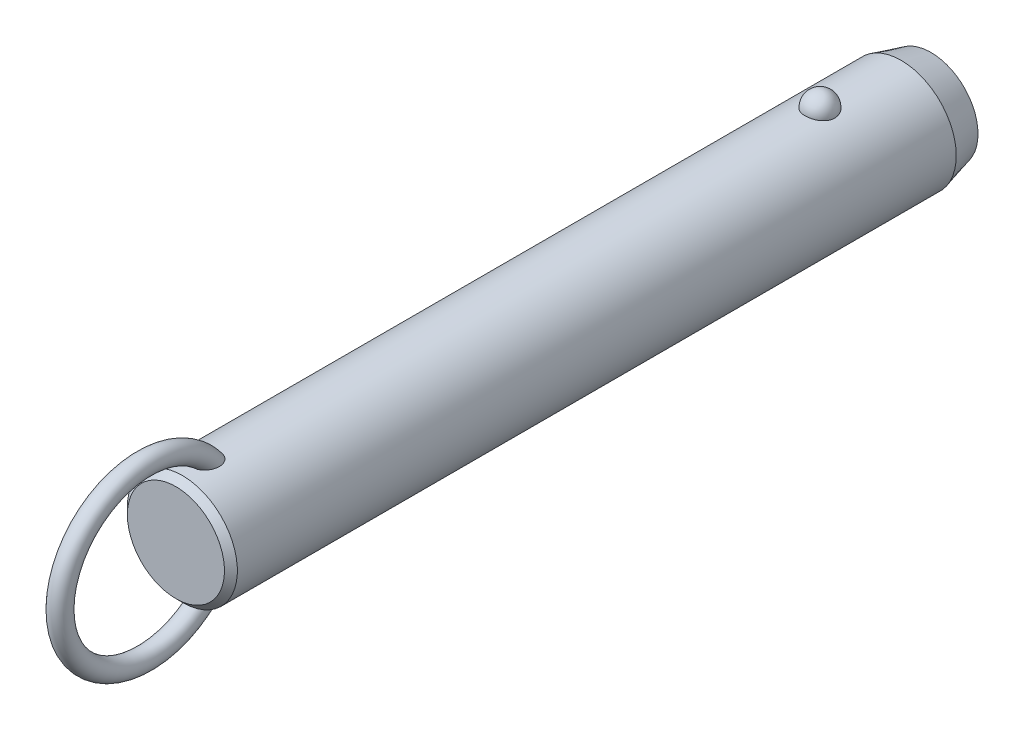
ISO-10303-21;
HEADER;
FILE_DESCRIPTION(('STEP AP214'),'2;1');
FILE_NAME('part.step','',(''),(''),'','','');
FILE_SCHEMA(('AUTOMOTIVE_DESIGN { 1 0 10303 214 1 1 1 1 }'));
ENDSEC;
DATA;
#1=APPLICATION_CONTEXT('core data for automotive mechanical design processes');
#2=APPLICATION_PROTOCOL_DEFINITION('international standard','automotive_design',2000,#1);
#3=PRODUCT_CONTEXT('',#1,'mechanical');
#4=PRODUCT('Part','Part','',(#3));
#5=PRODUCT_RELATED_PRODUCT_CATEGORY('part','',(#4));
#6=PRODUCT_DEFINITION_FORMATION('','',#4);
#7=PRODUCT_DEFINITION_CONTEXT('part definition',#1,'design');
#8=PRODUCT_DEFINITION('design','',#6,#7);
#9=PRODUCT_DEFINITION_SHAPE('','',#8);
#10=(LENGTH_UNIT() NAMED_UNIT(*) SI_UNIT(.MILLI.,.METRE.));
#11=(NAMED_UNIT(*) PLANE_ANGLE_UNIT() SI_UNIT($,.RADIAN.));
#12=(NAMED_UNIT(*) SI_UNIT($,.STERADIAN.) SOLID_ANGLE_UNIT());
#13=UNCERTAINTY_MEASURE_WITH_UNIT(LENGTH_MEASURE(1.E-05),#10,'distance_accuracy_value','');
#14=(GEOMETRIC_REPRESENTATION_CONTEXT(3) GLOBAL_UNCERTAINTY_ASSIGNED_CONTEXT((#13)) GLOBAL_UNIT_ASSIGNED_CONTEXT((#10,
#11,#12)) REPRESENTATION_CONTEXT('',''));
#15=CARTESIAN_POINT('',(0.,0.,0.));
#16=DIRECTION('',(0.,0.,1.));
#17=DIRECTION('',(1.,0.,0.));
#18=AXIS2_PLACEMENT_3D('',#15,#16,#17);
#19=CARTESIAN_POINT('',(0.,0.,114.3));
#20=DIRECTION('',(0.,0.,-1.));
#21=DIRECTION('',(-1.,0.,0.));
#22=AXIS2_PLACEMENT_3D('',#19,#20,#21);
#23=CYLINDRICAL_SURFACE('',#22,11.1);
#24=CARTESIAN_POINT('',(2.9724815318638,10.6945945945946,-3.));
#25=CARTESIAN_POINT('',(2.97247830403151,10.6945972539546,-2.83225059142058));
#26=CARTESIAN_POINT('',(2.95876598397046,10.6984356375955,-2.66445972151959));
#27=CARTESIAN_POINT('',(2.90424529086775,10.7133624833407,-2.33362381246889));
#28=CARTESIAN_POINT('',(2.8634252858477,10.7244540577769,-2.1705808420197));
#29=CARTESIAN_POINT('',(2.75573657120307,10.7526272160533,-1.85396767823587));
#30=CARTESIAN_POINT('',(2.68887937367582,10.7697061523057,-1.70039333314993));
#31=CARTESIAN_POINT('',(2.53079696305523,10.8079438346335,-1.40691598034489));
#32=CARTESIAN_POINT('',(2.43957264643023,10.8291024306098,-1.2670124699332));
#33=CARTESIAN_POINT('',(2.23458150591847,10.8732541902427,-1.00409565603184));
#34=CARTESIAN_POINT('',(2.12071295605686,10.8962553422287,-0.881162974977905));
#35=CARTESIAN_POINT('',(1.87365402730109,10.9414421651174,-0.656352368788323));
#36=CARTESIAN_POINT('',(1.74046358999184,10.9636278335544,-0.554474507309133));
#37=CARTESIAN_POINT('',(1.45872188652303,11.0046495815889,-0.374872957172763));
#38=CARTESIAN_POINT('',(1.31021276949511,11.0234944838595,-0.297085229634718));
#39=CARTESIAN_POINT('',(1.00170030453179,11.0557957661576,-0.167529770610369));
#40=CARTESIAN_POINT('',(0.841698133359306,11.0692526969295,-0.115759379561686));
#41=CARTESIAN_POINT('',(0.517607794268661,11.0890932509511,-0.0403925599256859));
#42=CARTESIAN_POINT('',(0.353633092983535,11.0955916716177,-0.0163383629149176));
#43=CARTESIAN_POINT('',(0.0238420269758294,11.1011989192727,0.0044517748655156));
#44=CARTESIAN_POINT('',(-0.141974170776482,11.1003084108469,0.00119017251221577));
#45=CARTESIAN_POINT('',(-0.468405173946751,11.0912990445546,-0.0323233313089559));
#46=CARTESIAN_POINT('',(-0.629059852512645,11.0832767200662,-0.0622147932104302));
#47=CARTESIAN_POINT('',(-0.942937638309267,11.0609962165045,-0.147645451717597));
#48=CARTESIAN_POINT('',(-1.09616062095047,11.0467379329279,-0.203185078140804));
#49=CARTESIAN_POINT('',(-1.39181061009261,11.0134071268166,-0.3387529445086));
#50=CARTESIAN_POINT('',(-1.53417383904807,10.9943086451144,-0.418913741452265));
#51=CARTESIAN_POINT('',(-1.80342160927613,10.9533667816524,-0.60144882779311));
#52=CARTESIAN_POINT('',(-1.9303046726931,10.9315231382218,-0.703825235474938));
#53=CARTESIAN_POINT('',(-2.16747598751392,10.887005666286,-0.930091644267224));
#54=CARTESIAN_POINT('',(-2.27742774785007,10.8643239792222,-1.05433291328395));
#55=CARTESIAN_POINT('',(-2.47517316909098,10.8209886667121,-1.31966633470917));
#56=CARTESIAN_POINT('',(-2.56296538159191,10.8003351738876,-1.46075958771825));
#57=CARTESIAN_POINT('',(-2.71500300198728,10.7631304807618,-1.75753646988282));
#58=CARTESIAN_POINT('',(-2.77898901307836,10.7466250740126,-1.91335887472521));
#59=CARTESIAN_POINT('',(-2.88046189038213,10.7198747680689,-2.2339152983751));
#60=CARTESIAN_POINT('',(-2.91794947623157,10.709629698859,-2.39864907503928));
#61=CARTESIAN_POINT('',(-2.96537819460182,10.6965949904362,-2.73165170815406));
#62=CARTESIAN_POINT('',(-2.97542891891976,10.693775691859,-2.89990378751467));
#63=CARTESIAN_POINT('',(-2.96804271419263,10.6958279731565,-3.235752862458));
#64=CARTESIAN_POINT('',(-2.95060646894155,10.7006993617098,-3.40334987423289));
#65=CARTESIAN_POINT('',(-2.88883358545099,10.71753912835,-3.73233906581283));
#66=CARTESIAN_POINT('',(-2.84462026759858,10.7294749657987,-3.89375610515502));
#67=CARTESIAN_POINT('',(-2.73050447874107,10.7590797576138,-4.20667949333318));
#68=CARTESIAN_POINT('',(-2.66060103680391,10.7767489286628,-4.35818546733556));
#69=CARTESIAN_POINT('',(-2.49642559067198,10.8159599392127,-4.6478542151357));
#70=CARTESIAN_POINT('',(-2.40203047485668,10.8375211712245,-4.78594458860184));
#71=CARTESIAN_POINT('',(-2.19143488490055,10.8820570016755,-5.0441038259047));
#72=CARTESIAN_POINT('',(-2.07523364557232,10.9050316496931,-5.16417205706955));
#73=CARTESIAN_POINT('',(-1.82361254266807,10.9499219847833,-5.38334833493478));
#74=CARTESIAN_POINT('',(-1.68812945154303,10.9718338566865,-5.48238464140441));
#75=CARTESIAN_POINT('',(-1.40191298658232,11.0120611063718,-5.65618873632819));
#76=CARTESIAN_POINT('',(-1.25118062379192,11.0303767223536,-5.73095813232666));
#77=CARTESIAN_POINT('',(-0.940570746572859,11.0611653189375,-5.85334725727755));
#78=CARTESIAN_POINT('',(-0.780821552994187,11.0737044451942,-5.90127578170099));
#79=CARTESIAN_POINT('',(-0.455204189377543,11.0918598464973,-5.96992976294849));
#80=CARTESIAN_POINT('',(-0.289336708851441,11.0974768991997,-5.99065827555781));
#81=CARTESIAN_POINT('',(0.0406846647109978,11.1011307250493,-6.00418773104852));
#82=CARTESIAN_POINT('',(0.204817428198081,11.099299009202,-5.99747318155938));
#83=CARTESIAN_POINT('',(0.5295530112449,11.088551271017,-5.9574031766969));
#84=CARTESIAN_POINT('',(0.69015594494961,11.0796354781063,-5.92404858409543));
#85=CARTESIAN_POINT('',(1.0027760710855,11.0557204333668,-5.83180084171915));
#86=CARTESIAN_POINT('',(1.15482001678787,11.0407414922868,-5.77299291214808));
#87=CARTESIAN_POINT('',(1.44678373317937,11.0062913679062,-5.63147366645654));
#88=CARTESIAN_POINT('',(1.58670279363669,10.9868199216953,-5.54876095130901));
#89=CARTESIAN_POINT('',(1.8527023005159,10.9451315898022,-5.36027644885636));
#90=CARTESIAN_POINT('',(1.97855158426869,10.9228788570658,-5.25418644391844));
#91=CARTESIAN_POINT('',(2.21080872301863,10.8782509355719,-5.02251354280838));
#92=CARTESIAN_POINT('',(2.31721312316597,10.8558757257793,-4.89692718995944));
#93=CARTESIAN_POINT('',(2.5094551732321,10.8130715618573,-4.62745408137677));
#94=CARTESIAN_POINT('',(2.59493284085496,10.7926798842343,-4.48330448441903));
#95=CARTESIAN_POINT('',(2.740862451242,10.7565495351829,-4.18236358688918));
#96=CARTESIAN_POINT('',(2.80132490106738,10.7408089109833,-4.02557762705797));
#97=CARTESIAN_POINT('',(2.88959070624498,10.7173718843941,-3.72475308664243));
#98=CARTESIAN_POINT('',(2.92062102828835,10.7088950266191,-3.58171216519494));
#99=CARTESIAN_POINT('',(2.96206765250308,10.6975052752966,-3.29245795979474));
#100=CARTESIAN_POINT('',(2.97248434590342,10.6945922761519,-3.14624473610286));
#101=CARTESIAN_POINT('',(2.9724815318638,10.6945945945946,-3.));
#102=B_SPLINE_CURVE_WITH_KNOTS('',3,(#24,#25,#26,#27,#28,#29,#30,#31,#32,#33,#34,#35,#36,#37,
#38,#39,#40,#41,#42,#43,#44,#45,#46,#47,#48,#49,#50,#51,#52,#53,#54,#55,#56,#57,#58,#59,#60,#61,
#62,#63,#64,#65,#66,#67,#68,#69,#70,#71,#72,#73,#74,#75,#76,#77,#78,#79,#80,#81,#82,#83,#84,#85,
#86,#87,#88,#89,#90,#91,#92,#93,#94,#95,#96,#97,#98,#99,#100,#101),.UNSPECIFIED.,.T.,.F.,(4,2,2,
2,2,2,2,2,2,2,2,2,2,2,2,2,2,2,2,2,2,2,2,2,2,2,2,2,2,2,2,2,2,2,2,2,2,2,4),(0.,0.502722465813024,
1.00566079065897,1.5083769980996,2.01107471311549,2.51608392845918,3.02109467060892,
3.52475118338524,4.02835620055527,4.523518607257,5.0186364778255,5.50715297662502,
5.9956776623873,6.48688002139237,6.97812923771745,7.47814366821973,7.9781907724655,
8.48353712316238,8.9888697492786,9.49218093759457,9.99547960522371,10.4964777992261,
10.997494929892,11.5010810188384,12.0046847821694,12.5099796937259,13.0152411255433,
13.5145635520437,14.0138298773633,14.5043200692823,14.9947943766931,15.4836390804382,
15.9725123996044,16.4685040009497,16.9645836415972,17.4686765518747,17.972557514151,
18.410841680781,18.849117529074),.UNSPECIFIED.);
#103=CARTESIAN_POINT('',(2.9724815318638,10.6945945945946,-3.));
#104=VERTEX_POINT('',#103);
#105=EDGE_CURVE('E41',#104,#104,#102,.T.);
#106=ORIENTED_EDGE('',*,*,#105,.T.);
#107=EDGE_LOOP('',(#106));
#108=FACE_BOUND('',#107,.T.);
#109=CARTESIAN_POINT('',(0.,0.,125.7));
#110=DIRECTION('',(0.,0.,1.));
#111=DIRECTION('',(1.,0.,0.));
#112=AXIS2_PLACEMENT_3D('',#109,#110,#111);
#113=CIRCLE('',#112,11.1);
#114=CARTESIAN_POINT('',(-11.1,0.,125.7));
#115=VERTEX_POINT('',#114);
#116=EDGE_CURVE('E10',#115,#115,#113,.F.);
#117=ORIENTED_EDGE('',*,*,#116,.T.);
#118=EDGE_LOOP('',(#117));
#119=FACE_BOUND('',#118,.T.);
#120=CARTESIAN_POINT('',(-0.564520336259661,-11.0856356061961,117.957815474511));
#121=CARTESIAN_POINT('',(-0.667202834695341,-11.0804062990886,117.991283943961));
#122=CARTESIAN_POINT('',(-0.766875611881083,-11.0738877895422,118.033835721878));
#123=CARTESIAN_POINT('',(-0.957284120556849,-11.0590576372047,118.135419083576));
#124=CARTESIAN_POINT('',(-1.04801616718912,-11.0507452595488,118.19445742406));
#125=CARTESIAN_POINT('',(-1.21800952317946,-11.0333016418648,118.326529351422));
#126=CARTESIAN_POINT('',(-1.29730805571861,-11.0241732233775,118.399515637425));
#127=CARTESIAN_POINT('',(-1.44337665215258,-11.0060026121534,118.557037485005));
#128=CARTESIAN_POINT('',(-1.51014622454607,-10.9969604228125,118.641573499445));
#129=CARTESIAN_POINT('',(-1.63454620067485,-10.9791841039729,118.825521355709));
#130=CARTESIAN_POINT('',(-1.69127003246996,-10.9705107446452,118.925549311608));
#131=CARTESIAN_POINT('',(-1.78980785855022,-10.9548648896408,119.132790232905));
#132=CARTESIAN_POINT('',(-1.83161214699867,-10.9478935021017,119.240007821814));
#133=CARTESIAN_POINT('',(-1.91557028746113,-10.9335803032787,119.505408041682));
#134=CARTESIAN_POINT('',(-1.95040620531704,-10.9273269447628,119.665980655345));
#135=CARTESIAN_POINT('',(-1.99388326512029,-10.9194709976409,119.990697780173));
#136=CARTESIAN_POINT('',(-2.00248051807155,-10.9178762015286,120.154847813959));
#137=CARTESIAN_POINT('',(-1.99551615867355,-10.9191578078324,120.524650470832));
#138=CARTESIAN_POINT('',(-1.9732206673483,-10.9232807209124,120.730191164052));
#139=CARTESIAN_POINT('',(-1.9152976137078,-10.9335244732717,121.033595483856));
#140=CARTESIAN_POINT('',(-1.8918457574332,-10.9376266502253,121.134088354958));
#141=CARTESIAN_POINT('',(-1.83700674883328,-10.9469720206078,121.332855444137));
#142=CARTESIAN_POINT('',(-1.80562070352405,-10.9522150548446,121.431129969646));
#143=CARTESIAN_POINT('',(-1.73463055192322,-10.9636837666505,121.625914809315));
#144=CARTESIAN_POINT('',(-1.6949341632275,-10.9699202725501,121.722390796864));
#145=CARTESIAN_POINT('',(-1.6074514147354,-10.9830806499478,121.911626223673));
#146=CARTESIAN_POINT('',(-1.55966150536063,-10.9900048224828,122.004384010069));
#147=CARTESIAN_POINT('',(-1.45591812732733,-11.0042280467,122.184690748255));
#148=CARTESIAN_POINT('',(-1.40000013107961,-11.0115253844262,122.272260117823));
#149=CARTESIAN_POINT('',(-1.2793747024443,-11.0261911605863,122.441029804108));
#150=CARTESIAN_POINT('',(-1.2146783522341,-11.0335594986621,122.52223795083));
#151=CARTESIAN_POINT('',(-1.08218150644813,-11.0473027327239,122.669001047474));
#152=CARTESIAN_POINT('',(-1.0152263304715,-11.0537063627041,122.735309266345));
#153=CARTESIAN_POINT('',(-0.872952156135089,-11.065850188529,122.858378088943));
#154=CARTESIAN_POINT('',(-0.797642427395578,-11.0715911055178,122.915149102));
#155=CARTESIAN_POINT('',(-0.651396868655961,-11.081071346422,123.007515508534));
#156=CARTESIAN_POINT('',(-0.581712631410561,-11.0849841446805,123.045049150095));
#157=CARTESIAN_POINT('',(-0.437066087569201,-11.0916271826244,123.108259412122));
#158=CARTESIAN_POINT('',(-0.362109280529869,-11.0943586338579,123.133948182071));
#159=CARTESIAN_POINT('',(-0.207828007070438,-11.0983242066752,123.171117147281));
#160=CARTESIAN_POINT('',(-0.128467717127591,-11.0995432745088,123.182454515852));
#161=CARTESIAN_POINT('',(0.0309101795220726,-11.1002423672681,123.188965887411));
#162=CARTESIAN_POINT('',(0.110927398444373,-11.0997233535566,123.184148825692));
#163=CARTESIAN_POINT('',(0.256406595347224,-11.097240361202,123.160959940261));
#164=CARTESIAN_POINT('',(0.322235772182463,-11.0955074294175,123.144754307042));
#165=CARTESIAN_POINT('',(0.450635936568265,-11.0910350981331,123.102600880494));
#166=CARTESIAN_POINT('',(0.513205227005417,-11.0882951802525,123.076648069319));
#167=CARTESIAN_POINT('',(0.6626263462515,-11.0805620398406,123.002607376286));
#168=CARTESIAN_POINT('',(0.74712753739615,-11.0751144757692,122.949845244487));
#169=CARTESIAN_POINT('',(0.906756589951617,-11.0631932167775,122.831720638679));
#170=CARTESIAN_POINT('',(0.981859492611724,-11.0567168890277,122.766325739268));
#171=CARTESIAN_POINT('',(1.10712207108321,-11.0447856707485,122.64226337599));
#172=CARTESIAN_POINT('',(1.15909566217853,-11.0394280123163,122.585383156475));
#173=CARTESIAN_POINT('',(1.25791923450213,-11.0286040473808,122.467327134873));
#174=CARTESIAN_POINT('',(1.30476642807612,-11.0231376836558,122.406149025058));
#175=CARTESIAN_POINT('',(1.43818612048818,-11.0068027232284,122.217305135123));
#176=CARTESIAN_POINT('',(1.51751767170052,-10.9960104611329,122.084453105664));
#177=CARTESIAN_POINT('',(1.63597546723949,-10.9788847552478,121.853137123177));
#178=CARTESIAN_POINT('',(1.67988876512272,-10.9722190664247,121.757053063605));
#179=CARTESIAN_POINT('',(1.75953241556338,-10.9597298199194,121.561431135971));
#180=CARTESIAN_POINT('',(1.79525967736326,-10.9539065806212,121.461891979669));
#181=CARTESIAN_POINT('',(1.85844731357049,-10.9433632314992,121.26021118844));
#182=CARTESIAN_POINT('',(1.88591073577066,-10.9386427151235,121.158070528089));
#183=CARTESIAN_POINT('',(1.93234324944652,-10.9305350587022,120.951819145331));
#184=CARTESIAN_POINT('',(1.95131065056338,-10.9271481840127,120.847708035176));
#185=CARTESIAN_POINT('',(1.99040203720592,-10.9201183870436,120.565458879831));
#186=CARTESIAN_POINT('',(2.00221217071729,-10.9179256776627,120.386037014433));
#187=CARTESIAN_POINT('',(1.99711676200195,-10.9188636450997,120.027713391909));
#188=CARTESIAN_POINT('',(1.98026150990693,-10.9219849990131,119.848811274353));
#189=CARTESIAN_POINT('',(1.92151657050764,-10.9324473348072,119.53645144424));
#190=CARTESIAN_POINT('',(1.88605081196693,-10.9386915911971,119.401759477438));
#191=CARTESIAN_POINT('',(1.79393020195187,-10.9541780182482,119.139966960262));
#192=CARTESIAN_POINT('',(1.73729868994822,-10.9634168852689,119.012858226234));
#193=CARTESIAN_POINT('',(1.61237037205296,-10.9824218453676,118.789418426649));
#194=CARTESIAN_POINT('',(1.54715374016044,-10.9918945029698,118.691345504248));
#195=CARTESIAN_POINT('',(1.40127026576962,-11.0114415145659,118.507434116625));
#196=CARTESIAN_POINT('',(1.3206074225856,-11.0215157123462,118.421592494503));
#197=CARTESIAN_POINT('',(1.1447478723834,-11.041168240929,118.265163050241));
#198=CARTESIAN_POINT('',(1.04947805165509,-11.0507437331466,118.194656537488));
#199=CARTESIAN_POINT('',(0.84727806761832,-11.0680789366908,118.072640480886));
#200=CARTESIAN_POINT('',(0.740351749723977,-11.0758392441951,118.021124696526));
#201=CARTESIAN_POINT('',(0.529289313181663,-11.0878275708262,117.943485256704));
#202=CARTESIAN_POINT('',(0.425895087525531,-11.0923259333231,117.915377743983));
#203=CARTESIAN_POINT('',(0.215723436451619,-11.0984001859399,117.877703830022));
#204=CARTESIAN_POINT('',(0.108947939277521,-11.0999777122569,117.868127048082));
#205=CARTESIAN_POINT('',(-0.0938962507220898,-11.1000196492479,117.867877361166));
#206=CARTESIAN_POINT('',(-0.189967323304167,-11.0987797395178,117.875408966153));
#207=CARTESIAN_POINT('',(-0.379657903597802,-11.0939111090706,117.905507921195));
#208=CARTESIAN_POINT('',(-0.473277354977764,-11.0902823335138,117.928075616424));
#209=CARTESIAN_POINT('',(-0.564520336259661,-11.0856356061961,117.957815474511));
#210=B_SPLINE_CURVE_WITH_KNOTS('',3,(#120,#121,#122,#123,#124,#125,#126,#127,#128,#129,#130,
#131,#132,#133,#134,#135,#136,#137,#138,#139,#140,#141,#142,#143,#144,#145,#146,#147,#148,#149,
#150,#151,#152,#153,#154,#155,#156,#157,#158,#159,#160,#161,#162,#163,#164,#165,#166,#167,#168,
#169,#170,#171,#172,#173,#174,#175,#176,#177,#178,#179,#180,#181,#182,#183,#184,#185,#186,#187,
#188,#189,#190,#191,#192,#193,#194,#195,#196,#197,#198,#199,#200,#201,#202,#203,#204,#205,#206,
#207,#208,#209),.UNSPECIFIED.,.T.,.F.,(4,2,2,2,2,2,2,2,2,2,2,2,2,2,2,2,2,2,2,2,2,2,2,2,2,2,2,2,
2,2,2,2,2,2,2,2,2,2,2,2,2,2,2,2,4),(0.,0.323999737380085,0.648132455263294,0.971184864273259,
1.2942499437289,1.6388623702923,1.98369857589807,2.47426059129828,2.96564271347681,
3.58257396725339,3.89215258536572,4.201688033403,4.51486273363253,4.82817514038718,
5.14015911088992,5.45175282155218,5.734428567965,6.01679375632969,6.25364580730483,
6.49025437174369,6.72919963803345,6.96801276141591,7.17061258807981,7.37331685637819,
7.67094989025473,7.9693572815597,8.20075067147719,8.43226927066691,8.89581623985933,
9.21306533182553,9.53043400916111,9.84768549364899,10.1650000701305,10.7022930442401,
11.2386443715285,11.6553390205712,12.0715755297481,12.4245637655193,12.7774607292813,
13.1321855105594,13.4867936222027,13.8068771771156,14.1267813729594,14.4146787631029,
14.7025827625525),.UNSPECIFIED.);
#211=CARTESIAN_POINT('',(-0.564520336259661,-11.0856356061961,117.957815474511));
#212=VERTEX_POINT('',#211);
#213=EDGE_CURVE('E60',#212,#212,#210,.T.);
#214=ORIENTED_EDGE('',*,*,#213,.T.);
#215=EDGE_LOOP('',(#214));
#216=FACE_BOUND('',#215,.T.);
#217=CARTESIAN_POINT('',(-0.564520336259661,11.0856356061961,117.957815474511));
#218=CARTESIAN_POINT('',(-0.468542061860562,11.0905203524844,117.926545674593));
#219=CARTESIAN_POINT('',(-0.36979381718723,11.0942886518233,117.903157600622));
#220=CARTESIAN_POINT('',(-0.169555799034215,11.0991586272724,117.873085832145));
#221=CARTESIAN_POINT('',(-0.0680604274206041,11.1002543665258,117.86643932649));
#222=CARTESIAN_POINT('',(0.134549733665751,11.099646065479,117.870157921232));
#223=CARTESIAN_POINT('',(0.235664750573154,11.0979441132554,117.88051033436));
#224=CARTESIAN_POINT('',(0.434632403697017,11.0919342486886,117.917831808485));
#225=CARTESIAN_POINT('',(0.532486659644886,11.0876276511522,117.944792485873));
#226=CARTESIAN_POINT('',(0.722445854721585,11.0768742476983,118.0144096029));
#227=CARTESIAN_POINT('',(0.814543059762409,11.0704246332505,118.057086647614));
#228=CARTESIAN_POINT('',(0.99056508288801,11.0560659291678,118.156648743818));
#229=CARTESIAN_POINT('',(1.07448844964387,11.048156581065,118.213536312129));
#230=CARTESIAN_POINT('',(1.23562672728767,11.0313221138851,118.342210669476));
#231=CARTESIAN_POINT('',(1.3124268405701,11.0223686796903,118.414511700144));
#232=CARTESIAN_POINT('',(1.45398030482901,11.0045918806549,118.570042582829));
#233=CARTESIAN_POINT('',(1.5187307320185,10.9957685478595,118.653275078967));
#234=CARTESIAN_POINT('',(1.64107232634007,10.9782087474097,118.836384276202));
#235=CARTESIAN_POINT('',(1.69743176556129,10.9695572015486,118.937089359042));
#236=CARTESIAN_POINT('',(1.79515063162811,10.9539887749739,119.145626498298));
#237=CARTESIAN_POINT('',(1.83649966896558,10.9470730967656,119.25346343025));
#238=CARTESIAN_POINT('',(1.91931148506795,10.9329211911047,119.520399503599));
#239=CARTESIAN_POINT('',(1.95340104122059,10.9267904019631,119.681861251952));
#240=CARTESIAN_POINT('',(1.99526195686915,10.9192174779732,120.00821631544));
#241=CARTESIAN_POINT('',(2.00298989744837,10.9177830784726,120.17311484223));
#242=CARTESIAN_POINT('',(1.9939625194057,10.9194420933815,120.544100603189));
#243=CARTESIAN_POINT('',(1.97050829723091,10.923774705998,120.75003871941));
#244=CARTESIAN_POINT('',(1.91079643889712,10.9343131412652,121.053901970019));
#245=CARTESIAN_POINT('',(1.88673702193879,10.9385106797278,121.154529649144));
#246=CARTESIAN_POINT('',(1.83065508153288,10.9480376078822,121.353510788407));
#247=CARTESIAN_POINT('',(1.79863369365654,10.9533668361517,121.451864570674));
#248=CARTESIAN_POINT('',(1.72633365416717,10.9649954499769,121.646720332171));
#249=CARTESIAN_POINT('',(1.68596409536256,10.9713053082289,121.74318790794));
#250=CARTESIAN_POINT('',(1.59707998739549,10.9845964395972,121.932323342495));
#251=CARTESIAN_POINT('',(1.54856169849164,10.9915780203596,122.024989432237));
#252=CARTESIAN_POINT('',(1.44330168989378,11.0058935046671,122.204975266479));
#253=CARTESIAN_POINT('',(1.38659749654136,11.0132257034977,122.292316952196));
#254=CARTESIAN_POINT('',(1.26431158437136,11.0279330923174,122.460456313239));
#255=CARTESIAN_POINT('',(1.19874160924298,11.0353082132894,122.541262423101));
#256=CARTESIAN_POINT('',(1.06542088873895,11.048931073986,122.685985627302));
#257=CARTESIAN_POINT('',(0.998640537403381,11.0552153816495,122.750784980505));
#258=CARTESIAN_POINT('',(0.856896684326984,11.0671032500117,122.870846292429));
#259=CARTESIAN_POINT('',(0.781942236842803,11.0727075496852,122.926118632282));
#260=CARTESIAN_POINT('',(0.636276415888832,11.081949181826,123.015972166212));
#261=CARTESIAN_POINT('',(0.566755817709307,11.0857572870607,123.052441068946));
#262=CARTESIAN_POINT('',(0.422602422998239,11.0921860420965,123.113533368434));
#263=CARTESIAN_POINT('',(0.347974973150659,11.0948079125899,123.138168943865));
#264=CARTESIAN_POINT('',(0.19459385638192,11.0985608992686,123.173323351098));
#265=CARTESIAN_POINT('',(0.115807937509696,11.0996777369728,123.183706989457));
#266=CARTESIAN_POINT('',(-0.0422499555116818,11.1002003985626,123.188574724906));
#267=CARTESIAN_POINT('',(-0.121521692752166,11.09960699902,123.183066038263));
#268=CARTESIAN_POINT('',(-0.266046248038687,11.0970123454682,123.158827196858));
#269=CARTESIAN_POINT('',(-0.331661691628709,11.0952283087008,123.142135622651));
#270=CARTESIAN_POINT('',(-0.459588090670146,11.0906663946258,123.099111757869));
#271=CARTESIAN_POINT('',(-0.521897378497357,11.0878880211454,123.072774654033));
#272=CARTESIAN_POINT('',(-0.671446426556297,11.0800342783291,122.997513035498));
#273=CARTESIAN_POINT('',(-0.756250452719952,11.0744969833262,122.943818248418));
#274=CARTESIAN_POINT('',(-0.916349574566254,11.0624045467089,122.823802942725));
#275=CARTESIAN_POINT('',(-0.991618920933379,11.0558467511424,122.757449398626));
#276=CARTESIAN_POINT('',(-1.11713140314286,11.0437783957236,122.631633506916));
#277=CARTESIAN_POINT('',(-1.16920539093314,11.0383619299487,122.573952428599));
#278=CARTESIAN_POINT('',(-1.26817476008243,11.02743010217,122.454280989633));
#279=CARTESIAN_POINT('',(-1.31506731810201,11.0219146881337,122.392288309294));
#280=CARTESIAN_POINT('',(-1.40399813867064,11.0109399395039,122.264784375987));
#281=CARTESIAN_POINT('',(-1.44602864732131,11.0054807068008,122.199267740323));
#282=CARTESIAN_POINT('',(-1.52538779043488,10.9947621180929,122.065422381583));
#283=CARTESIAN_POINT('',(-1.56271516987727,10.9895028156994,121.997092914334));
#284=CARTESIAN_POINT('',(-1.64537943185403,10.9774790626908,121.833210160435));
#285=CARTESIAN_POINT('',(-1.68879497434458,10.9708503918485,121.7366735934));
#286=CARTESIAN_POINT('',(-1.76740738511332,10.9584602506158,121.540236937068));
#287=CARTESIAN_POINT('',(-1.80260120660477,10.95269910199,121.44033561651));
#288=CARTESIAN_POINT('',(-1.86468657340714,10.9423003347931,121.237966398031));
#289=CARTESIAN_POINT('',(-1.89158164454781,10.9376622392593,121.135499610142));
#290=CARTESIAN_POINT('',(-1.93682458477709,10.9297405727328,120.928642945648));
#291=CARTESIAN_POINT('',(-1.9551708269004,10.9264572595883,120.824252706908));
#292=CARTESIAN_POINT('',(-1.99232562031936,10.9197647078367,120.54262876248));
#293=CARTESIAN_POINT('',(-2.00294603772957,10.9177914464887,120.364185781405));
#294=CARTESIAN_POINT('',(-1.99566675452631,10.9191290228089,120.007996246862));
#295=CARTESIAN_POINT('',(-1.97781651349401,10.9224306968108,119.83024902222));
#296=CARTESIAN_POINT('',(-1.91747214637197,10.93315926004,119.519792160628));
#297=CARTESIAN_POINT('',(-1.88131022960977,10.9395108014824,119.385825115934));
#298=CARTESIAN_POINT('',(-1.7879038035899,10.9551659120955,119.12559757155));
#299=CARTESIAN_POINT('',(-1.73068309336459,10.9644661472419,118.999328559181));
#300=CARTESIAN_POINT('',(-1.60475573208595,10.9835398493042,118.77741565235));
#301=CARTESIAN_POINT('',(-1.53908879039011,10.9930297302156,118.680026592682));
#302=CARTESIAN_POINT('',(-1.39238608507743,11.0125708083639,118.497525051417));
#303=CARTESIAN_POINT('',(-1.31135150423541,11.0226219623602,118.412411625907));
#304=CARTESIAN_POINT('',(-1.14382035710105,11.0411991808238,118.26529943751));
#305=CARTESIAN_POINT('',(-1.05858500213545,11.0497792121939,118.20186930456));
#306=CARTESIAN_POINT('',(-0.878723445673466,11.0655285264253,118.090250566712));
#307=CARTESIAN_POINT('',(-0.784123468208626,11.0727015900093,118.042020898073));
#308=CARTESIAN_POINT('',(-0.646163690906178,11.0812501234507,117.986023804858));
#309=CARTESIAN_POINT('',(-0.605595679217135,11.0835451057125,117.971197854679));
#310=CARTESIAN_POINT('',(-0.564520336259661,11.0856356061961,117.957815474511));
#311=B_SPLINE_CURVE_WITH_KNOTS('',3,(#217,#218,#219,#220,#221,#222,#223,#224,#225,#226,#227,
#228,#229,#230,#231,#232,#233,#234,#235,#236,#237,#238,#239,#240,#241,#242,#243,#244,#245,#246,
#247,#248,#249,#250,#251,#252,#253,#254,#255,#256,#257,#258,#259,#260,#261,#262,#263,#264,#265,
#266,#267,#268,#269,#270,#271,#272,#273,#274,#275,#276,#277,#278,#279,#280,#281,#282,#283,#284,
#285,#286,#287,#288,#289,#290,#291,#292,#293,#294,#295,#296,#297,#298,#299,#300,#301,#302,#303,
#304,#305,#306,#307,#308,#309,#310),.UNSPECIFIED.,.T.,.F.,(4,2,2,2,2,2,2,2,2,2,2,2,2,2,2,2,2,2,
2,2,2,2,2,2,2,2,2,2,2,2,2,2,2,2,2,2,2,2,2,2,2,2,2,2,2,2,4),(0.,0.303061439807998,
0.606795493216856,0.910302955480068,1.21365733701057,1.51741085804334,1.82121821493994,
2.13745205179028,2.45376252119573,2.79958678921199,3.14564996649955,3.6383239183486,
4.13180893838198,4.75031912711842,5.06071926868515,5.37107516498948,5.6850077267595,
5.99908475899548,6.31176519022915,6.62403542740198,6.90315673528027,7.1819719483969,
7.41687778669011,7.65154134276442,7.88841587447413,8.12518286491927,8.32752842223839,
8.52997509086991,8.82986421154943,9.13054668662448,9.36393502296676,9.59744991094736,
9.83133221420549,10.0652767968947,10.383032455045,10.7009056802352,11.0186436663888,
11.3364420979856,11.8705925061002,12.4038159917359,12.8189662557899,13.2336487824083,
13.5857049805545,13.9377340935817,14.2561354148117,14.5736690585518,14.7033687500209),.UNSPECIFIED.);
#312=CARTESIAN_POINT('',(-0.564520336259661,11.0856356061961,117.957815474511));
#313=VERTEX_POINT('',#312);
#314=EDGE_CURVE('E68',#313,#313,#311,.T.);
#315=ORIENTED_EDGE('',*,*,#314,.T.);
#316=EDGE_LOOP('',(#315));
#317=FACE_BOUND('',#316,.T.);
#318=CARTESIAN_POINT('',(0.,0.,-19.3999999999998));
#319=DIRECTION('',(0.,0.,-1.));
#320=DIRECTION('',(-1.,0.,0.));
#321=AXIS2_PLACEMENT_3D('',#318,#319,#320);
#322=CIRCLE('',#321,11.1);
#323=CARTESIAN_POINT('',(11.1,0.,-19.3999999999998));
#324=VERTEX_POINT('',#323);
#325=EDGE_CURVE('E57',#324,#324,#322,.F.);
#326=ORIENTED_EDGE('',*,*,#325,.T.);
#327=EDGE_LOOP('',(#326));
#328=FACE_BOUND('',#327,.T.);
#329=ADVANCED_FACE('F37',(#108,#119,#216,#317,#328),#23,.T.);
#330=CARTESIAN_POINT('',(0.,0.,-25.4));
#331=DIRECTION('',(0.,0.,-1.));
#332=DIRECTION('',(-1.,0.,0.));
#333=AXIS2_PLACEMENT_3D('',#330,#331,#332);
#334=PLANE('',#333);
#335=CARTESIAN_POINT('',(0.,0.,-25.4));
#336=DIRECTION('',(0.,0.,-1.));
#337=DIRECTION('',(-1.,0.,0.));
#338=AXIS2_PLACEMENT_3D('',#335,#336,#337);
#339=CIRCLE('',#338,9.49230484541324);
#340=CARTESIAN_POINT('',(9.49230484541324,0.,-25.4));
#341=VERTEX_POINT('',#340);
#342=EDGE_CURVE('E67',#341,#341,#339,.T.);
#343=ORIENTED_EDGE('',*,*,#342,.T.);
#344=EDGE_LOOP('',(#343));
#345=FACE_BOUND('',#344,.T.);
#346=ADVANCED_FACE('F86',(#345),#334,.T.);
#347=CARTESIAN_POINT('',(0.,0.,-25.4));
#348=DIRECTION('',(0.,0.,1.));
#349=DIRECTION('',(1.,0.,0.));
#350=AXIS2_PLACEMENT_3D('',#347,#348,#349);
#351=CONICAL_SURFACE('',#350,9.49230484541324,0.261799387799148);
#352=CARTESIAN_POINT('',(11.1,0.,-19.3999999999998));
#353=CARTESIAN_POINT('',(11.0832531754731,0.,-19.4624999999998));
#354=CARTESIAN_POINT('',(11.0665063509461,0.,-19.5249999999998));
#355=CARTESIAN_POINT('',(11.0330127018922,0.,-19.6499999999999));
#356=CARTESIAN_POINT('',(11.0162658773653,0.,-19.7124999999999));
#357=CARTESIAN_POINT('',(10.9827722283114,0.,-19.8374999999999));
#358=CARTESIAN_POINT('',(10.9660254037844,0.,-19.8999999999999));
#359=CARTESIAN_POINT('',(10.9325317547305,0.,-20.0249999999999));
#360=CARTESIAN_POINT('',(10.9157849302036,0.,-20.0874999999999));
#361=CARTESIAN_POINT('',(10.8822912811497,0.,-20.2124999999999));
#362=CARTESIAN_POINT('',(10.8655444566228,0.,-20.2749999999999));
#363=CARTESIAN_POINT('',(10.8320508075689,0.,-20.3999999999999));
#364=CARTESIAN_POINT('',(10.8153039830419,0.,-20.4624999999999));
#365=CARTESIAN_POINT('',(10.781810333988,0.,-20.5874999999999));
#366=CARTESIAN_POINT('',(10.7650635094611,0.,-20.6499999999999));
#367=CARTESIAN_POINT('',(10.7315698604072,0.,-20.7749999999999));
#368=CARTESIAN_POINT('',(10.7148230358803,0.,-20.8374999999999));
#369=CARTESIAN_POINT('',(10.6813293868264,0.,-20.9624999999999));
#370=CARTESIAN_POINT('',(10.6645825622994,0.,-21.0249999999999));
#371=CARTESIAN_POINT('',(10.6310889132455,0.,-21.1499999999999));
#372=CARTESIAN_POINT('',(10.6143420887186,0.,-21.2124999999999));
#373=CARTESIAN_POINT('',(10.5808484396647,0.,-21.3374999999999));
#374=CARTESIAN_POINT('',(10.5641016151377,0.,-21.3999999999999));
#375=CARTESIAN_POINT('',(10.5306079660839,0.,-21.5249999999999));
#376=CARTESIAN_POINT('',(10.5138611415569,0.,-21.5874999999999));
#377=CARTESIAN_POINT('',(10.480367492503,0.,-21.7124999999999));
#378=CARTESIAN_POINT('',(10.4636206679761,0.,-21.7749999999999));
#379=CARTESIAN_POINT('',(10.4301270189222,0.,-21.8999999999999));
#380=CARTESIAN_POINT('',(10.4133801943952,0.,-21.9624999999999));
#381=CARTESIAN_POINT('',(10.3798865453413,0.,-22.0874999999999));
#382=CARTESIAN_POINT('',(10.3631397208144,0.,-22.1499999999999));
#383=CARTESIAN_POINT('',(10.3296460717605,0.,-22.2749999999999));
#384=CARTESIAN_POINT('',(10.3128992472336,0.,-22.3374999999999));
#385=CARTESIAN_POINT('',(10.2794055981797,0.,-22.4624999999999));
#386=CARTESIAN_POINT('',(10.2626587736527,0.,-22.5249999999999));
#387=CARTESIAN_POINT('',(10.2291651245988,0.,-22.6499999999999));
#388=CARTESIAN_POINT('',(10.2124183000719,0.,-22.7124999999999));
#389=CARTESIAN_POINT('',(10.178924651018,0.,-22.8374999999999));
#390=CARTESIAN_POINT('',(10.1621778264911,0.,-22.8999999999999));
#391=CARTESIAN_POINT('',(10.1286841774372,0.,-23.0249999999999));
#392=CARTESIAN_POINT('',(10.1119373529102,0.,-23.0874999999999));
#393=CARTESIAN_POINT('',(10.0784437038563,0.,-23.2124999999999));
#394=CARTESIAN_POINT('',(10.0616968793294,0.,-23.2749999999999));
#395=CARTESIAN_POINT('',(10.0282032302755,0.,-23.3999999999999));
#396=CARTESIAN_POINT('',(10.0114564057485,0.,-23.4624999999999));
#397=CARTESIAN_POINT('',(9.97796275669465,0.,-23.5875));
#398=CARTESIAN_POINT('',(9.96121593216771,0.,-23.65));
#399=CARTESIAN_POINT('',(9.92772228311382,0.,-23.775));
#400=CARTESIAN_POINT('',(9.91097545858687,0.,-23.8375));
#401=CARTESIAN_POINT('',(9.87748180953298,0.,-23.9625));
#402=CARTESIAN_POINT('',(9.86073498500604,0.,-24.025));
#403=CARTESIAN_POINT('',(9.82724133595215,0.,-24.15));
#404=CARTESIAN_POINT('',(9.8104945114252,0.,-24.2125));
#405=CARTESIAN_POINT('',(9.77700086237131,0.,-24.3375));
#406=CARTESIAN_POINT('',(9.76025403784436,0.,-24.4));
#407=CARTESIAN_POINT('',(9.72676038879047,0.,-24.525));
#408=CARTESIAN_POINT('',(9.71001356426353,0.,-24.5875));
#409=CARTESIAN_POINT('',(9.67651991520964,0.,-24.7125));
#410=CARTESIAN_POINT('',(9.65977309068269,0.,-24.775));
#411=CARTESIAN_POINT('',(9.6262794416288,0.,-24.9));
#412=CARTESIAN_POINT('',(9.60953261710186,0.,-24.9625));
#413=CARTESIAN_POINT('',(9.57603896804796,0.,-25.0875));
#414=CARTESIAN_POINT('',(9.55929214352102,0.,-25.15));
#415=CARTESIAN_POINT('',(9.52579849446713,0.,-25.275));
#416=CARTESIAN_POINT('',(9.50905166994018,0.,-25.3375));
#417=CARTESIAN_POINT('',(9.49230484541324,0.,-25.4));
#418=B_SPLINE_CURVE_WITH_KNOTS('',3,(#352,#353,#354,#355,#356,#357,#358,#359,#360,#361,#362,
#363,#364,#365,#366,#367,#368,#369,#370,#371,#372,#373,#374,#375,#376,#377,#378,#379,#380,#381,
#382,#383,#384,#385,#386,#387,#388,#389,#390,#391,#392,#393,#394,#395,#396,#397,#398,#399,#400,
#401,#402,#403,#404,#405,#406,#407,#408,#409,#410,#411,#412,#413,#414,#415,#416,#417),
.UNSPECIFIED.,.F.,.F.,(4,2,2,2,2,2,2,2,2,2,2,2,2,2,2,2,2,2,2,2,2,2,2,2,2,2,2,2,2,2,2,2,4),(0.,
0.194114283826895,0.388228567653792,0.582342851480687,0.776457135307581,0.970571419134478,
1.16468570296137,1.35879998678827,1.55291427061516,1.74702855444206,1.94114283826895,
2.13525712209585,2.32937140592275,2.52348568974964,2.71759997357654,2.91171425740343,
3.10582854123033,3.29994282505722,3.49405710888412,3.68817139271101,3.88228567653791,
4.07639996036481,4.2705142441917,4.4646285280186,4.65874281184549,4.85285709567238,
5.04697137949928,5.24108566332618,5.43519994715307,5.62931423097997,5.82342851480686,
6.01754279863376,6.21165708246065),.UNSPECIFIED.);
#419=EDGE_CURVE('BSEAM84',#324,#341,#418,.T.);
#420=ORIENTED_EDGE('',*,*,#325,.F.);
#421=ORIENTED_EDGE('',*,*,#342,.F.);
#422=ORIENTED_EDGE('',*,*,#419,.T.);
#423=ORIENTED_EDGE('',*,*,#419,.F.);
#424=EDGE_LOOP('',(#420,#422,#421,#423));
#425=FACE_BOUND('',#424,.T.);
#426=ADVANCED_FACE('F84',(#425),#351,.T.);
#427=CARTESIAN_POINT('',(0.,0.,127.));
#428=DIRECTION('',(0.,0.,1.));
#429=DIRECTION('',(1.,0.,0.));
#430=AXIS2_PLACEMENT_3D('',#427,#428,#429);
#431=PLANE('',#430);
#432=CARTESIAN_POINT('',(0.,0.,127.));
#433=DIRECTION('',(0.,0.,1.));
#434=DIRECTION('',(1.,0.,0.));
#435=AXIS2_PLACEMENT_3D('',#432,#433,#434);
#436=CIRCLE('',#435,9.8);
#437=CARTESIAN_POINT('',(-9.80000000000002,0.,127.));
#438=VERTEX_POINT('',#437);
#439=EDGE_CURVE('E50',#438,#438,#436,.T.);
#440=ORIENTED_EDGE('',*,*,#439,.T.);
#441=EDGE_LOOP('',(#440));
#442=FACE_BOUND('',#441,.T.);
#443=ADVANCED_FACE('F78',(#442),#431,.T.);
#444=CARTESIAN_POINT('',(0.,0.,133.35));
#445=DIRECTION('',(1.,0.,0.));
#446=DIRECTION('',(0.,0.,-1.));
#447=AXIS2_PLACEMENT_3D('',#444,#445,#446);
#448=TOROIDAL_SURFACE('',#447,17.05,2.);
#449=ORIENTED_EDGE('',*,*,#314,.F.);
#450=EDGE_LOOP('',(#449));
#451=FACE_BOUND('',#450,.T.);
#452=ORIENTED_EDGE('',*,*,#213,.F.);
#453=EDGE_LOOP('',(#452));
#454=FACE_BOUND('',#453,.T.);
#455=ADVANCED_FACE('F74',(#451,#454),#448,.T.);
#456=CARTESIAN_POINT('',(0.,0.,127.));
#457=DIRECTION('',(0.,0.,-1.));
#458=DIRECTION('',(-1.,0.,0.));
#459=AXIS2_PLACEMENT_3D('',#456,#457,#458);
#460=CONICAL_SURFACE('',#459,9.8,0.785398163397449);
#461=CARTESIAN_POINT('',(-11.1,0.,125.7));
#462=CARTESIAN_POINT('',(-11.0864583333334,0.,125.713541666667));
#463=CARTESIAN_POINT('',(-11.0729166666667,0.,125.727083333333));
#464=CARTESIAN_POINT('',(-11.0458333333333,0.,125.754166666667));
#465=CARTESIAN_POINT('',(-11.0322916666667,0.,125.767708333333));
#466=CARTESIAN_POINT('',(-11.0052083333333,0.,125.794791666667));
#467=CARTESIAN_POINT('',(-10.9916666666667,0.,125.808333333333));
#468=CARTESIAN_POINT('',(-10.9645833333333,0.,125.835416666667));
#469=CARTESIAN_POINT('',(-10.9510416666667,0.,125.848958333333));
#470=CARTESIAN_POINT('',(-10.9239583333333,0.,125.876041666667));
#471=CARTESIAN_POINT('',(-10.9104166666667,0.,125.889583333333));
#472=CARTESIAN_POINT('',(-10.8833333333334,0.,125.916666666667));
#473=CARTESIAN_POINT('',(-10.8697916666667,0.,125.930208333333));
#474=CARTESIAN_POINT('',(-10.8427083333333,0.,125.957291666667));
#475=CARTESIAN_POINT('',(-10.8291666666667,0.,125.970833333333));
#476=CARTESIAN_POINT('',(-10.8020833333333,0.,125.997916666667));
#477=CARTESIAN_POINT('',(-10.7885416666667,0.,126.011458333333));
#478=CARTESIAN_POINT('',(-10.7614583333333,0.,126.038541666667));
#479=CARTESIAN_POINT('',(-10.7479166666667,0.,126.052083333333));
#480=CARTESIAN_POINT('',(-10.7208333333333,0.,126.079166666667));
#481=CARTESIAN_POINT('',(-10.7072916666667,0.,126.092708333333));
#482=CARTESIAN_POINT('',(-10.6802083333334,0.,126.119791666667));
#483=CARTESIAN_POINT('',(-10.6666666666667,0.,126.133333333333));
#484=CARTESIAN_POINT('',(-10.6395833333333,0.,126.160416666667));
#485=CARTESIAN_POINT('',(-10.6260416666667,0.,126.173958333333));
#486=CARTESIAN_POINT('',(-10.5989583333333,0.,126.201041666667));
#487=CARTESIAN_POINT('',(-10.5854166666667,0.,126.214583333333));
#488=CARTESIAN_POINT('',(-10.5583333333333,0.,126.241666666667));
#489=CARTESIAN_POINT('',(-10.5447916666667,0.,126.255208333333));
#490=CARTESIAN_POINT('',(-10.5177083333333,0.,126.282291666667));
#491=CARTESIAN_POINT('',(-10.5041666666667,0.,126.295833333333));
#492=CARTESIAN_POINT('',(-10.4770833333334,0.,126.322916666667));
#493=CARTESIAN_POINT('',(-10.4635416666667,0.,126.336458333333));
#494=CARTESIAN_POINT('',(-10.4364583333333,0.,126.363541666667));
#495=CARTESIAN_POINT('',(-10.4229166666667,0.,126.377083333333));
#496=CARTESIAN_POINT('',(-10.3958333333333,0.,126.404166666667));
#497=CARTESIAN_POINT('',(-10.3822916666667,0.,126.417708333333));
#498=CARTESIAN_POINT('',(-10.3552083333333,0.,126.444791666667));
#499=CARTESIAN_POINT('',(-10.3416666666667,0.,126.458333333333));
#500=CARTESIAN_POINT('',(-10.3145833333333,0.,126.485416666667));
#501=CARTESIAN_POINT('',(-10.3010416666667,0.,126.498958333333));
#502=CARTESIAN_POINT('',(-10.2739583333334,0.,126.526041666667));
#503=CARTESIAN_POINT('',(-10.2604166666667,0.,126.539583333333));
#504=CARTESIAN_POINT('',(-10.2333333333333,0.,126.566666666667));
#505=CARTESIAN_POINT('',(-10.2197916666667,0.,126.580208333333));
#506=CARTESIAN_POINT('',(-10.1927083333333,0.,126.607291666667));
#507=CARTESIAN_POINT('',(-10.1791666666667,0.,126.620833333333));
#508=CARTESIAN_POINT('',(-10.1520833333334,0.,126.647916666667));
#509=CARTESIAN_POINT('',(-10.1385416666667,0.,126.661458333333));
#510=CARTESIAN_POINT('',(-10.1114583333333,0.,126.688541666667));
#511=CARTESIAN_POINT('',(-10.0979166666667,0.,126.702083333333));
#512=CARTESIAN_POINT('',(-10.0708333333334,0.,126.729166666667));
#513=CARTESIAN_POINT('',(-10.0572916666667,0.,126.742708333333));
#514=CARTESIAN_POINT('',(-10.0302083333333,0.,126.769791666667));
#515=CARTESIAN_POINT('',(-10.0166666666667,0.,126.783333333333));
#516=CARTESIAN_POINT('',(-9.98958333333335,0.,126.810416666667));
#517=CARTESIAN_POINT('',(-9.97604166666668,0.,126.823958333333));
#518=CARTESIAN_POINT('',(-9.94895833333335,0.,126.851041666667));
#519=CARTESIAN_POINT('',(-9.93541666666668,0.,126.864583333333));
#520=CARTESIAN_POINT('',(-9.90833333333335,0.,126.891666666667));
#521=CARTESIAN_POINT('',(-9.89479166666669,0.,126.905208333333));
#522=CARTESIAN_POINT('',(-9.86770833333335,0.,126.932291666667));
#523=CARTESIAN_POINT('',(-9.85416666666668,0.,126.945833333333));
#524=CARTESIAN_POINT('',(-9.82708333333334,0.,126.972916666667));
#525=CARTESIAN_POINT('',(-9.81354166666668,0.,126.986458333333));
#526=CARTESIAN_POINT('',(-9.80000000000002,0.,127.));
#527=B_SPLINE_CURVE_WITH_KNOTS('',3,(#461,#462,#463,#464,#465,#466,#467,#468,#469,#470,#471,
#472,#473,#474,#475,#476,#477,#478,#479,#480,#481,#482,#483,#484,#485,#486,#487,#488,#489,#490,
#491,#492,#493,#494,#495,#496,#497,#498,#499,#500,#501,#502,#503,#504,#505,#506,#507,#508,#509,
#510,#511,#512,#513,#514,#515,#516,#517,#518,#519,#520,#521,#522,#523,#524,#525,#526),
.UNSPECIFIED.,.F.,.F.,(4,2,2,2,2,2,2,2,2,2,2,2,2,2,2,2,2,2,2,2,2,2,2,2,2,2,2,2,2,2,2,2,4),(0.,
0.0574524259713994,0.114904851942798,0.172357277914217,0.229809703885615,0.287262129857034,
0.344714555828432,0.402166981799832,0.459619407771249,0.517071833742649,0.574524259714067,
0.631976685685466,0.689429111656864,0.746881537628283,0.804333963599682,0.861786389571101,
0.9192388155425,0.976691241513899,1.03414366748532,1.09159609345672,1.14904851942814,
1.20650094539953,1.26395337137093,1.32140579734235,1.37885822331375,1.43631064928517,
1.49376307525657,1.55121550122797,1.60866792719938,1.66612035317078,1.7235727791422,
1.7810252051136,1.83847763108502),.UNSPECIFIED.);
#528=EDGE_CURVE('BSEAM39',#115,#438,#527,.T.);
#529=ORIENTED_EDGE('',*,*,#116,.F.);
#530=ORIENTED_EDGE('',*,*,#439,.F.);
#531=ORIENTED_EDGE('',*,*,#528,.T.);
#532=ORIENTED_EDGE('',*,*,#528,.F.);
#533=EDGE_LOOP('',(#529,#531,#530,#532));
#534=FACE_BOUND('',#533,.T.);
#535=ADVANCED_FACE('F39',(#534),#460,.T.);
#536=CARTESIAN_POINT('',(0.,11.1,-3.));
#537=DIRECTION('',(0.,1.,0.));
#538=DIRECTION('',(0.,0.,-1.));
#539=AXIS2_PLACEMENT_3D('',#536,#537,#538);
#540=SPHERICAL_SURFACE('',#539,3.);
#541=ORIENTED_EDGE('',*,*,#105,.F.);
#542=EDGE_LOOP('',(#541));
#543=FACE_BOUND('',#542,.T.);
#544=ADVANCED_FACE('F80',(#543),#540,.T.);
#545=CLOSED_SHELL('',(#329,#346,#426,#443,#455,#535,#544));
#546=MANIFOLD_SOLID_BREP('B2',#545);
#547=ADVANCED_BREP_SHAPE_REPRESENTATION('',(#18,#546),#14);
#548=SHAPE_DEFINITION_REPRESENTATION(#9,#547);
ENDSEC;
END-ISO-10303-21;
